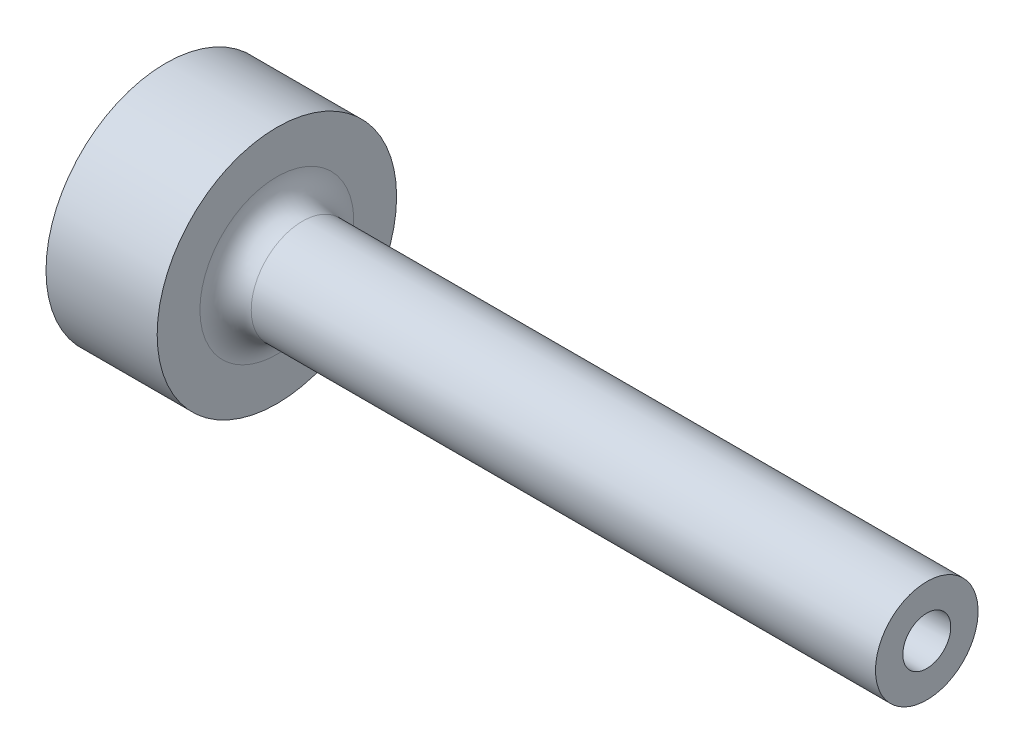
ISO-10303-21;
HEADER;
FILE_DESCRIPTION(('STEP AP214'),'2;1');
FILE_NAME('part.step','',(''),(''),'','','');
FILE_SCHEMA(('AUTOMOTIVE_DESIGN { 1 0 10303 214 1 1 1 1 }'));
ENDSEC;
DATA;
#1=APPLICATION_CONTEXT('core data for automotive mechanical design processes');
#2=APPLICATION_PROTOCOL_DEFINITION('international standard','automotive_design',2000,#1);
#3=PRODUCT_CONTEXT('',#1,'mechanical');
#4=PRODUCT('Part','Part','',(#3));
#5=PRODUCT_RELATED_PRODUCT_CATEGORY('part','',(#4));
#6=PRODUCT_DEFINITION_FORMATION('','',#4);
#7=PRODUCT_DEFINITION_CONTEXT('part definition',#1,'design');
#8=PRODUCT_DEFINITION('design','',#6,#7);
#9=PRODUCT_DEFINITION_SHAPE('','',#8);
#10=(LENGTH_UNIT() NAMED_UNIT(*) SI_UNIT(.MILLI.,.METRE.));
#11=(NAMED_UNIT(*) PLANE_ANGLE_UNIT() SI_UNIT($,.RADIAN.));
#12=(NAMED_UNIT(*) SI_UNIT($,.STERADIAN.) SOLID_ANGLE_UNIT());
#13=UNCERTAINTY_MEASURE_WITH_UNIT(LENGTH_MEASURE(1.E-05),#10,'distance_accuracy_value','');
#14=(GEOMETRIC_REPRESENTATION_CONTEXT(3) GLOBAL_UNCERTAINTY_ASSIGNED_CONTEXT((#13)) GLOBAL_UNIT_ASSIGNED_CONTEXT((#10,
#11,#12)) REPRESENTATION_CONTEXT('',''));
#15=CARTESIAN_POINT('',(0.,0.,0.));
#16=DIRECTION('',(0.,0.,1.));
#17=DIRECTION('',(1.,0.,0.));
#18=AXIS2_PLACEMENT_3D('',#15,#16,#17);
#19=CARTESIAN_POINT('',(0.,0.,0.));
#20=DIRECTION('',(-1.,0.,0.));
#21=DIRECTION('',(0.,0.,1.));
#22=AXIS2_PLACEMENT_3D('',#19,#20,#21);
#23=CYLINDRICAL_SURFACE('',#22,14.);
#24=CARTESIAN_POINT('',(13.,0.,0.));
#25=DIRECTION('',(-1.,0.,0.));
#26=DIRECTION('',(0.,0.,1.));
#27=AXIS2_PLACEMENT_3D('',#24,#25,#26);
#28=CIRCLE('',#27,14.);
#29=CARTESIAN_POINT('',(13.,0.,14.));
#30=VERTEX_POINT('',#29);
#31=EDGE_CURVE('E88',#30,#30,#28,.T.);
#32=ORIENTED_EDGE('',*,*,#31,.T.);
#33=EDGE_LOOP('',(#32));
#34=FACE_BOUND('',#33,.T.);
#35=CARTESIAN_POINT('',(0.,0.,0.));
#36=DIRECTION('',(-1.,0.,0.));
#37=DIRECTION('',(0.,0.,1.));
#38=AXIS2_PLACEMENT_3D('',#35,#36,#37);
#39=CIRCLE('',#38,14.);
#40=CARTESIAN_POINT('',(0.,0.,14.));
#41=VERTEX_POINT('',#40);
#42=EDGE_CURVE('E83',#41,#41,#39,.T.);
#43=ORIENTED_EDGE('',*,*,#42,.F.);
#44=EDGE_LOOP('',(#43));
#45=FACE_BOUND('',#44,.T.);
#46=CARTESIAN_POINT('',(6.5,-13.856406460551,-2.));
#47=CARTESIAN_POINT('',(6.61172417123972,-13.8564082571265,-1.99999534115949));
#48=CARTESIAN_POINT('',(6.72351471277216,-13.8577723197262,-1.99060664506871));
#49=CARTESIAN_POINT('',(6.9439746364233,-13.8630779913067,-1.95330740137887));
#50=CARTESIAN_POINT('',(7.05264079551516,-13.8670221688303,-1.92537839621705));
#51=CARTESIAN_POINT('',(7.26362870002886,-13.8770324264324,-1.85184738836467));
#52=CARTESIAN_POINT('',(7.36595507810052,-13.8830969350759,-1.80625847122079));
#53=CARTESIAN_POINT('',(7.56148972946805,-13.8966626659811,-1.69873175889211));
#54=CARTESIAN_POINT('',(7.65469934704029,-13.9041636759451,-1.63679637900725));
#55=CARTESIAN_POINT('',(7.83004829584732,-13.9198182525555,-1.49785346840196));
#56=CARTESIAN_POINT('',(7.91211171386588,-13.9279757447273,-1.42075056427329));
#57=CARTESIAN_POINT('',(8.06218155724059,-13.9439890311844,-1.25386707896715));
#58=CARTESIAN_POINT('',(8.13018723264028,-13.9518448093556,-1.16408582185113));
#59=CARTESIAN_POINT('',(8.25048909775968,-13.9664103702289,-0.973910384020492));
#60=CARTESIAN_POINT('',(8.30271571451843,-13.9731150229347,-0.873471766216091));
#61=CARTESIAN_POINT('',(8.38953073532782,-13.9845795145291,-0.665136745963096));
#62=CARTESIAN_POINT('',(8.4241199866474,-13.9893394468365,-0.557240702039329));
#63=CARTESIAN_POINT('',(8.47444920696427,-13.9963505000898,-0.337834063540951));
#64=CARTESIAN_POINT('',(8.49031606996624,-13.9986185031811,-0.226353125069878));
#65=CARTESIAN_POINT('',(8.5031438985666,-14.0004479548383,-0.00228956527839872));
#66=CARTESIAN_POINT('',(8.50010582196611,-14.0000095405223,0.110292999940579));
#67=CARTESIAN_POINT('',(8.47531062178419,-13.9964890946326,0.33249899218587));
#68=CARTESIAN_POINT('',(8.45369000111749,-13.9934263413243,0.442137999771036));
#69=CARTESIAN_POINT('',(8.39255744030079,-13.9850228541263,0.656215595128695));
#70=CARTESIAN_POINT('',(8.3530450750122,-13.9796820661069,0.760654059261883));
#71=CARTESIAN_POINT('',(8.25710925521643,-13.9672894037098,0.961781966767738));
#72=CARTESIAN_POINT('',(8.20062784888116,-13.9602316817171,1.05844339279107));
#73=CARTESIAN_POINT('',(8.07239950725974,-13.9451926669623,1.24096782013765));
#74=CARTESIAN_POINT('',(8.00065165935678,-13.9372113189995,1.32683017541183));
#75=CARTESIAN_POINT('',(7.843165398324,-13.921132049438,1.48612299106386));
#76=CARTESIAN_POINT('',(7.75730786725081,-13.9130337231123,1.55943569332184));
#77=CARTESIAN_POINT('',(7.57444547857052,-13.8977029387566,1.69062989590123));
#78=CARTESIAN_POINT('',(7.47744056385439,-13.890470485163,1.74851131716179));
#79=CARTESIAN_POINT('',(7.27491971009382,-13.8776905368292,1.84721301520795));
#80=CARTESIAN_POINT('',(7.1693981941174,-13.8721441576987,1.88802200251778));
#81=CARTESIAN_POINT('',(6.95290242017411,-13.8633846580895,1.9513062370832));
#82=CARTESIAN_POINT('',(6.84192850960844,-13.8601713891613,1.97378265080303));
#83=CARTESIAN_POINT('',(6.61872346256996,-13.8564698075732,1.99960390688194));
#84=CARTESIAN_POINT('',(6.50651197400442,-13.8559577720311,2.00311531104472));
#85=CARTESIAN_POINT('',(6.28310219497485,-13.8576537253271,1.9913480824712));
#86=CARTESIAN_POINT('',(6.17190387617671,-13.8598616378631,1.9760699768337));
#87=CARTESIAN_POINT('',(5.95418781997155,-13.8667269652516,1.92729837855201));
#88=CARTESIAN_POINT('',(5.84765127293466,-13.8713733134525,1.8938871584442));
#89=CARTESIAN_POINT('',(5.6416912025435,-13.8825829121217,1.80988306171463));
#90=CARTESIAN_POINT('',(5.54226800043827,-13.8891462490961,1.75928940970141));
#91=CARTESIAN_POINT('',(5.35260812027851,-13.9035064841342,1.64195360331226));
#92=CARTESIAN_POINT('',(5.26243903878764,-13.911311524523,1.57510320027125));
#93=CARTESIAN_POINT('',(5.09454027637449,-13.9272509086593,1.42730277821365));
#94=CARTESIAN_POINT('',(5.01681123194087,-13.9353852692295,1.34635203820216));
#95=CARTESIAN_POINT('',(4.8754047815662,-13.9511405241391,1.17191708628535));
#96=CARTESIAN_POINT('',(4.81183747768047,-13.9587570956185,1.07834317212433));
#97=CARTESIAN_POINT('',(4.70132443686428,-13.972552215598,0.881748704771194));
#98=CARTESIAN_POINT('',(4.65437828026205,-13.9787308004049,0.778728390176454));
#99=CARTESIAN_POINT('',(4.57861788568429,-13.9889347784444,0.566515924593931));
#100=CARTESIAN_POINT('',(4.54974241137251,-13.9929674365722,0.457345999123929));
#101=CARTESIAN_POINT('',(4.51074453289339,-13.9984555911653,0.235645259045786));
#102=CARTESIAN_POINT('',(4.50062101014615,-13.9999112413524,0.123114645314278));
#103=CARTESIAN_POINT('',(4.49943976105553,-14.0000800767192,-0.101043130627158));
#104=CARTESIAN_POINT('',(4.50821318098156,-13.998817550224,-0.212669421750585));
#105=CARTESIAN_POINT('',(4.54421615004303,-13.9937406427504,-0.432842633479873));
#106=CARTESIAN_POINT('',(4.57144565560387,-13.989926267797,-0.541389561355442));
#107=CARTESIAN_POINT('',(4.6435299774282,-13.9801722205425,-0.752283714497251));
#108=CARTESIAN_POINT('',(4.68837418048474,-13.9742338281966,-0.854634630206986));
#109=CARTESIAN_POINT('',(4.79439714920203,-13.960885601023,-1.05038570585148));
#110=CARTESIAN_POINT('',(4.8555763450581,-13.9534757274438,-1.14378562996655));
#111=CARTESIAN_POINT('',(4.99314771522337,-13.9379304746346,-1.31984194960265));
#112=CARTESIAN_POINT('',(5.06966490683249,-13.9297894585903,-1.40240016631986));
#113=CARTESIAN_POINT('',(5.2354775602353,-13.9137422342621,-1.55356716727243));
#114=CARTESIAN_POINT('',(5.32477602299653,-13.9058360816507,-1.6221726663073));
#115=CARTESIAN_POINT('',(5.51414543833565,-13.8911108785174,-1.74379523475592));
#116=CARTESIAN_POINT('',(5.61426869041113,-13.8842975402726,-1.79673154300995));
#117=CARTESIAN_POINT('',(5.82203229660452,-13.8725962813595,-1.88495902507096));
#118=CARTESIAN_POINT('',(5.92966459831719,-13.8677063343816,-1.92026877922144));
#119=CARTESIAN_POINT('',(6.11483642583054,-13.8615529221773,-1.96409255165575));
#120=CARTESIAN_POINT('',(6.19122433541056,-13.859633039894,-1.97753762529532));
#121=CARTESIAN_POINT('',(6.34506419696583,-13.857059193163,-1.99549291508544));
#122=CARTESIAN_POINT('',(6.42251613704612,-13.8564052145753,-2.00000323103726));
#123=CARTESIAN_POINT('',(6.5,-13.856406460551,-2.));
#124=B_SPLINE_CURVE_WITH_KNOTS('',3,(#46,#47,#48,#49,#50,#51,#52,#53,#54,#55,#56,#57,#58,#59,
#60,#61,#62,#63,#64,#65,#66,#67,#68,#69,#70,#71,#72,#73,#74,#75,#76,#77,#78,#79,#80,#81,#82,#83,
#84,#85,#86,#87,#88,#89,#90,#91,#92,#93,#94,#95,#96,#97,#98,#99,#100,#101,#102,#103,#104,#105,
#106,#107,#108,#109,#110,#111,#112,#113,#114,#115,#116,#117,#118,#119,#120,#121,#122,#123),
.UNSPECIFIED.,.T.,.F.,(4,2,2,2,2,2,2,2,2,2,2,2,2,2,2,2,2,2,2,2,2,2,2,2,2,2,2,2,2,2,2,2,2,2,2,2,
2,2,4),(0.,0.334889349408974,0.670112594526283,1.00508792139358,1.34001378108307,
1.6771171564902,2.01423851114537,2.35282530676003,2.6913958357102,3.02765822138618,
3.36390357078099,3.69769984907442,4.03150405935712,4.36646147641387,4.70143892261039,
5.03940517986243,5.37737316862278,5.7155642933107,6.05373389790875,6.3889286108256,
6.72411392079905,7.05779100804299,7.39148315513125,7.72746121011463,8.06345644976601,
8.40197921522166,8.74049343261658,9.07785422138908,9.41519488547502,9.74953375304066,
10.083871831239,10.4180087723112,10.7521545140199,11.0891434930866,11.426211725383,
11.7649881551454,12.103406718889,12.3356645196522,12.5679197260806),.UNSPECIFIED.);
#125=CARTESIAN_POINT('',(6.5,-13.856406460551,-2.));
#126=VERTEX_POINT('',#125);
#127=EDGE_CURVE('E9',#126,#126,#124,.T.);
#128=ORIENTED_EDGE('',*,*,#127,.F.);
#129=EDGE_LOOP('',(#128));
#130=FACE_BOUND('',#129,.T.);
#131=ADVANCED_FACE('F15',(#34,#45,#130),#23,.T.);
#132=CARTESIAN_POINT('',(0.,0.,0.));
#133=DIRECTION('',(1.,0.,0.));
#134=DIRECTION('',(0.,0.,-1.));
#135=AXIS2_PLACEMENT_3D('',#132,#133,#134);
#136=CONICAL_SURFACE('',#135,1.25,0.0174532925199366);
#137=CARTESIAN_POINT('',(89.,0.,0.));
#138=DIRECTION('',(-1.,0.,0.));
#139=DIRECTION('',(0.,0.,1.));
#140=AXIS2_PLACEMENT_3D('',#137,#138,#139);
#141=CIRCLE('',#140,2.80350077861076);
#142=CARTESIAN_POINT('',(89.,0.,2.80350077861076));
#143=VERTEX_POINT('',#142);
#144=EDGE_CURVE('E80',#143,#143,#141,.T.);
#145=ORIENTED_EDGE('',*,*,#144,.F.);
#146=EDGE_LOOP('',(#145));
#147=FACE_BOUND('',#146,.T.);
#148=CARTESIAN_POINT('',(0.924407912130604,0.,0.));
#149=DIRECTION('',(-1.,0.,0.));
#150=DIRECTION('',(0.,0.,1.));
#151=AXIS2_PLACEMENT_3D('',#148,#149,#150);
#152=CIRCLE('',#151,1.26613560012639);
#153=CARTESIAN_POINT('',(0.924407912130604,0.,1.26613560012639));
#154=VERTEX_POINT('',#153);
#155=EDGE_CURVE('E93',#154,#154,#152,.F.);
#156=ORIENTED_EDGE('',*,*,#155,.F.);
#157=EDGE_LOOP('',(#156));
#158=FACE_BOUND('',#157,.T.);
#159=ADVANCED_FACE('F44',(#147,#158),#136,.F.);
#160=CARTESIAN_POINT('',(16.,0.,0.));
#161=DIRECTION('',(-1.,0.,0.));
#162=DIRECTION('',(0.,0.,1.));
#163=AXIS2_PLACEMENT_3D('',#160,#161,#162);
#164=TOROIDAL_SURFACE('',#163,9.,3.);
#165=CARTESIAN_POINT('',(13.,0.,0.));
#166=DIRECTION('',(-1.,0.,0.));
#167=DIRECTION('',(0.,0.,1.));
#168=AXIS2_PLACEMENT_3D('',#165,#166,#167);
#169=CIRCLE('',#168,9.);
#170=CARTESIAN_POINT('',(13.,0.,9.));
#171=VERTEX_POINT('',#170);
#172=EDGE_CURVE('E90',#171,#171,#169,.T.);
#173=ORIENTED_EDGE('',*,*,#172,.F.);
#174=EDGE_LOOP('',(#173));
#175=FACE_BOUND('',#174,.T.);
#176=CARTESIAN_POINT('',(16.,0.,0.));
#177=DIRECTION('',(-1.,0.,0.));
#178=DIRECTION('',(0.,0.,1.));
#179=AXIS2_PLACEMENT_3D('',#176,#177,#178);
#180=CIRCLE('',#179,6.);
#181=CARTESIAN_POINT('',(16.,0.,6.));
#182=VERTEX_POINT('',#181);
#183=EDGE_CURVE('E27',#182,#182,#180,.T.);
#184=ORIENTED_EDGE('',*,*,#183,.T.);
#185=EDGE_LOOP('',(#184));
#186=FACE_BOUND('',#185,.T.);
#187=ADVANCED_FACE('F17',(#175,#186),#164,.F.);
#188=CARTESIAN_POINT('',(0.,0.,0.));
#189=DIRECTION('',(-1.,0.,0.));
#190=DIRECTION('',(0.,0.,1.));
#191=AXIS2_PLACEMENT_3D('',#188,#189,#190);
#192=CYLINDRICAL_SURFACE('',#191,6.);
#193=ORIENTED_EDGE('',*,*,#183,.F.);
#194=EDGE_LOOP('',(#193));
#195=FACE_BOUND('',#194,.T.);
#196=CARTESIAN_POINT('',(89.,0.,0.));
#197=DIRECTION('',(-1.,0.,0.));
#198=DIRECTION('',(0.,0.,1.));
#199=AXIS2_PLACEMENT_3D('',#196,#197,#198);
#200=CIRCLE('',#199,6.);
#201=CARTESIAN_POINT('',(89.,0.,6.));
#202=VERTEX_POINT('',#201);
#203=EDGE_CURVE('E79',#202,#202,#200,.T.);
#204=ORIENTED_EDGE('',*,*,#203,.T.);
#205=EDGE_LOOP('',(#204));
#206=FACE_BOUND('',#205,.T.);
#207=ADVANCED_FACE('F65',(#195,#206),#192,.T.);
#208=CARTESIAN_POINT('',(89.,6.,0.));
#209=DIRECTION('',(-1.,0.,0.));
#210=DIRECTION('',(0.,0.,1.));
#211=AXIS2_PLACEMENT_3D('',#208,#209,#210);
#212=PLANE('',#211);
#213=ORIENTED_EDGE('',*,*,#203,.F.);
#214=EDGE_LOOP('',(#213));
#215=FACE_BOUND('',#214,.T.);
#216=ORIENTED_EDGE('',*,*,#144,.T.);
#217=EDGE_LOOP('',(#216));
#218=FACE_BOUND('',#217,.T.);
#219=ADVANCED_FACE('F61',(#215,#218),#212,.F.);
#220=CARTESIAN_POINT('',(0.,1.25,0.));
#221=DIRECTION('',(1.,0.,0.));
#222=DIRECTION('',(0.,0.,-1.));
#223=AXIS2_PLACEMENT_3D('',#220,#221,#222);
#224=PLANE('',#223);
#225=CARTESIAN_POINT('',(0.,0.,0.));
#226=DIRECTION('',(-1.,0.,0.));
#227=DIRECTION('',(0.,0.,1.));
#228=AXIS2_PLACEMENT_3D('',#225,#226,#227);
#229=CIRCLE('',#228,5.);
#230=CARTESIAN_POINT('',(0.,0.,5.));
#231=VERTEX_POINT('',#230);
#232=EDGE_CURVE('E96',#231,#231,#229,.T.);
#233=ORIENTED_EDGE('',*,*,#232,.F.);
#234=EDGE_LOOP('',(#233));
#235=FACE_BOUND('',#234,.T.);
#236=ORIENTED_EDGE('',*,*,#42,.T.);
#237=EDGE_LOOP('',(#236));
#238=FACE_BOUND('',#237,.T.);
#239=ADVANCED_FACE('F59',(#235,#238),#224,.F.);
#240=CARTESIAN_POINT('',(13.,14.,0.));
#241=DIRECTION('',(-1.,0.,0.));
#242=DIRECTION('',(0.,0.,1.));
#243=AXIS2_PLACEMENT_3D('',#240,#241,#242);
#244=PLANE('',#243);
#245=ORIENTED_EDGE('',*,*,#31,.F.);
#246=EDGE_LOOP('',(#245));
#247=FACE_BOUND('',#246,.T.);
#248=ORIENTED_EDGE('',*,*,#172,.T.);
#249=EDGE_LOOP('',(#248));
#250=FACE_BOUND('',#249,.T.);
#251=ADVANCED_FACE('F57',(#247,#250),#244,.F.);
#252=CARTESIAN_POINT('',(-14.4672767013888,0.,0.));
#253=DIRECTION('',(-1.,0.,0.));
#254=DIRECTION('',(0.,0.,1.));
#255=AXIS2_PLACEMENT_3D('',#252,#253,#254);
#256=DEGENERATE_TOROIDAL_SURFACE('',#255,0.56308411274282,15.5,.F.);
#257=ORIENTED_EDGE('',*,*,#232,.T.);
#258=EDGE_LOOP('',(#257));
#259=FACE_BOUND('',#258,.T.);
#260=ORIENTED_EDGE('',*,*,#155,.T.);
#261=EDGE_LOOP('',(#260));
#262=FACE_BOUND('',#261,.T.);
#263=ADVANCED_FACE('F40',(#259,#262),#256,.T.);
#264=CARTESIAN_POINT('',(6.5,-14.,0.));
#265=DIRECTION('',(0.,-1.,0.));
#266=DIRECTION('',(0.,0.,-1.));
#267=AXIS2_PLACEMENT_3D('',#264,#265,#266);
#268=CYLINDRICAL_SURFACE('',#267,2.);
#269=CARTESIAN_POINT('',(6.5,-8.,0.));
#270=DIRECTION('',(0.,-1.,0.));
#271=DIRECTION('',(0.,0.,-1.));
#272=AXIS2_PLACEMENT_3D('',#269,#270,#271);
#273=CIRCLE('',#272,2.);
#274=CARTESIAN_POINT('',(6.5,-8.,-2.));
#275=VERTEX_POINT('',#274);
#276=EDGE_CURVE('E99',#275,#275,#273,.T.);
#277=ORIENTED_EDGE('',*,*,#276,.F.);
#278=EDGE_LOOP('',(#277));
#279=FACE_BOUND('',#278,.T.);
#280=ORIENTED_EDGE('',*,*,#127,.T.);
#281=EDGE_LOOP('',(#280));
#282=FACE_BOUND('',#281,.T.);
#283=ADVANCED_FACE('F32',(#279,#282),#268,.F.);
#284=CARTESIAN_POINT('',(6.5,-6.84529946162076,0.));
#285=DIRECTION('',(0.,-1.,0.));
#286=DIRECTION('',(0.,0.,-1.));
#287=AXIS2_PLACEMENT_3D('',#284,#285,#286);
#288=CONICAL_SURFACE('',#287,0.,1.0471975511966);
#289=ORIENTED_EDGE('',*,*,#276,.T.);
#290=EDGE_LOOP('',(#289));
#291=FACE_BOUND('',#290,.T.);
#292=CARTESIAN_POINT('',(6.5,-6.84529946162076,0.));
#293=VERTEX_POINT('',#292);
#294=VERTEX_LOOP('',#293);
#295=FACE_BOUND('',#294,.T.);
#296=ADVANCED_FACE('F30',(#291,#295),#288,.F.);
#297=CLOSED_SHELL('',(#131,#159,#187,#207,#219,#239,#251,#263,#283,#296));
#298=MANIFOLD_SOLID_BREP('B1',#297);
#299=ADVANCED_BREP_SHAPE_REPRESENTATION('',(#18,#298),#14);
#300=SHAPE_DEFINITION_REPRESENTATION(#9,#299);
ENDSEC;
END-ISO-10303-21;
